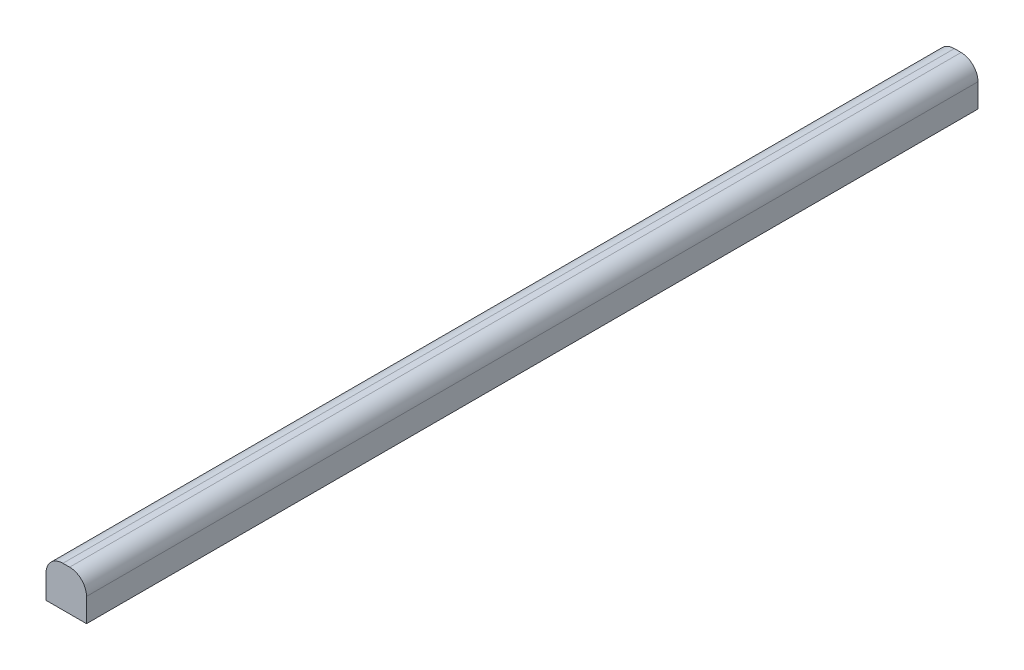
ISO-10303-21;
HEADER;
FILE_DESCRIPTION(('STEP AP214'),'2;1');
FILE_NAME('part.step','',(''),(''),'','','');
FILE_SCHEMA(('AUTOMOTIVE_DESIGN { 1 0 10303 214 1 1 1 1 }'));
ENDSEC;
DATA;
#1=APPLICATION_CONTEXT('core data for automotive mechanical design processes');
#2=APPLICATION_PROTOCOL_DEFINITION('international standard','automotive_design',2000,#1);
#3=PRODUCT_CONTEXT('',#1,'mechanical');
#4=PRODUCT('Part','Part','',(#3));
#5=PRODUCT_RELATED_PRODUCT_CATEGORY('part','',(#4));
#6=PRODUCT_DEFINITION_FORMATION('','',#4);
#7=PRODUCT_DEFINITION_CONTEXT('part definition',#1,'design');
#8=PRODUCT_DEFINITION('design','',#6,#7);
#9=PRODUCT_DEFINITION_SHAPE('','',#8);
#10=(LENGTH_UNIT() NAMED_UNIT(*) SI_UNIT(.MILLI.,.METRE.));
#11=(NAMED_UNIT(*) PLANE_ANGLE_UNIT() SI_UNIT($,.RADIAN.));
#12=(NAMED_UNIT(*) SI_UNIT($,.STERADIAN.) SOLID_ANGLE_UNIT());
#13=UNCERTAINTY_MEASURE_WITH_UNIT(LENGTH_MEASURE(1.E-05),#10,'distance_accuracy_value','');
#14=(GEOMETRIC_REPRESENTATION_CONTEXT(3) GLOBAL_UNCERTAINTY_ASSIGNED_CONTEXT((#13)) GLOBAL_UNIT_ASSIGNED_CONTEXT((#10,
#11,#12)) REPRESENTATION_CONTEXT('',''));
#15=CARTESIAN_POINT('',(0.,0.,0.));
#16=DIRECTION('',(0.,0.,1.));
#17=DIRECTION('',(1.,0.,0.));
#18=AXIS2_PLACEMENT_3D('',#15,#16,#17);
#19=CARTESIAN_POINT('',(0.5,3.,12.5));
#20=DIRECTION('',(0.,1.,0.));
#21=DIRECTION('',(0.,0.,1.));
#22=AXIS2_PLACEMENT_3D('',#19,#20,#21);
#23=PLANE('',#22);
#24=DIRECTION('',(1.,0.,0.));
#25=VECTOR('',#24,1.);
#26=CARTESIAN_POINT('',(0.5,3.,125.));
#27=LINE('',#26,#25);
#28=CARTESIAN_POINT('',(-0.5,3.,125.));
#29=VERTEX_POINT('',#28);
#30=CARTESIAN_POINT('',(0.5,3.,125.));
#31=VERTEX_POINT('',#30);
#32=EDGE_CURVE('E108',#29,#31,#27,.T.);
#33=ORIENTED_EDGE('',*,*,#32,.T.);
#34=DIRECTION('',(0.,0.,1.));
#35=VECTOR('',#34,1.);
#36=CARTESIAN_POINT('',(0.5,3.,12.5));
#37=LINE('',#36,#35);
#38=CARTESIAN_POINT('',(0.5,3.,-7.));
#39=VERTEX_POINT('',#38);
#40=EDGE_CURVE('E104',#39,#31,#37,.T.);
#41=ORIENTED_EDGE('',*,*,#40,.F.);
#42=DIRECTION('',(1.,0.,0.));
#43=VECTOR('',#42,1.);
#44=CARTESIAN_POINT('',(0.5,3.,-7.));
#45=LINE('',#44,#43);
#46=CARTESIAN_POINT('',(-0.5,3.,-7.));
#47=VERTEX_POINT('',#46);
#48=EDGE_CURVE('E75',#39,#47,#45,.F.);
#49=ORIENTED_EDGE('',*,*,#48,.T.);
#50=DIRECTION('',(0.,0.,1.));
#51=VECTOR('',#50,1.);
#52=CARTESIAN_POINT('',(-0.5,3.,12.5));
#53=LINE('',#52,#51);
#54=EDGE_CURVE('E87',#29,#47,#53,.F.);
#55=ORIENTED_EDGE('',*,*,#54,.F.);
#56=EDGE_LOOP('',(#33,#41,#49,#55));
#57=FACE_BOUND('',#56,.T.);
#58=ADVANCED_FACE('F17',(#57),#23,.T.);
#59=CARTESIAN_POINT('',(0.5,0.5,12.5));
#60=DIRECTION('',(0.,0.,1.));
#61=DIRECTION('',(1.,0.,0.));
#62=AXIS2_PLACEMENT_3D('',#59,#60,#61);
#63=CYLINDRICAL_SURFACE('',#62,2.5);
#64=CARTESIAN_POINT('',(0.5,0.5,125.));
#65=DIRECTION('',(0.,0.,1.));
#66=DIRECTION('',(1.,0.,0.));
#67=AXIS2_PLACEMENT_3D('',#64,#65,#66);
#68=CIRCLE('',#67,2.5);
#69=CARTESIAN_POINT('',(3.,0.5,125.));
#70=VERTEX_POINT('',#69);
#71=EDGE_CURVE('E92',#31,#70,#68,.F.);
#72=ORIENTED_EDGE('',*,*,#71,.T.);
#73=DIRECTION('',(0.,0.,1.));
#74=VECTOR('',#73,1.);
#75=CARTESIAN_POINT('',(3.,0.5,12.5));
#76=LINE('',#75,#74);
#77=CARTESIAN_POINT('',(3.,0.5,-7.));
#78=VERTEX_POINT('',#77);
#79=EDGE_CURVE('E89',#78,#70,#76,.T.);
#80=ORIENTED_EDGE('',*,*,#79,.F.);
#81=CARTESIAN_POINT('',(0.5,0.5,-7.));
#82=DIRECTION('',(0.,0.,1.));
#83=DIRECTION('',(1.,0.,0.));
#84=AXIS2_PLACEMENT_3D('',#81,#82,#83);
#85=CIRCLE('',#84,2.5);
#86=EDGE_CURVE('E20',#39,#78,#85,.F.);
#87=ORIENTED_EDGE('',*,*,#86,.F.);
#88=ORIENTED_EDGE('',*,*,#40,.T.);
#89=EDGE_LOOP('',(#72,#80,#87,#88));
#90=FACE_BOUND('',#89,.T.);
#91=ADVANCED_FACE('F90',(#90),#63,.T.);
#92=CARTESIAN_POINT('',(-0.5,0.5,12.5));
#93=DIRECTION('',(0.,0.,1.));
#94=DIRECTION('',(1.,0.,0.));
#95=AXIS2_PLACEMENT_3D('',#92,#93,#94);
#96=CYLINDRICAL_SURFACE('',#95,2.5);
#97=CARTESIAN_POINT('',(-0.5,0.5,125.));
#98=DIRECTION('',(0.,0.,1.));
#99=DIRECTION('',(1.,0.,0.));
#100=AXIS2_PLACEMENT_3D('',#97,#98,#99);
#101=CIRCLE('',#100,2.5);
#102=CARTESIAN_POINT('',(-3.,0.5,125.));
#103=VERTEX_POINT('',#102);
#104=EDGE_CURVE('E112',#103,#29,#101,.F.);
#105=ORIENTED_EDGE('',*,*,#104,.T.);
#106=ORIENTED_EDGE('',*,*,#54,.T.);
#107=CARTESIAN_POINT('',(-0.5,0.5,-7.));
#108=DIRECTION('',(0.,0.,1.));
#109=DIRECTION('',(1.,0.,0.));
#110=AXIS2_PLACEMENT_3D('',#107,#108,#109);
#111=CIRCLE('',#110,2.5);
#112=CARTESIAN_POINT('',(-3.,0.5,-7.));
#113=VERTEX_POINT('',#112);
#114=EDGE_CURVE('E86',#113,#47,#111,.F.);
#115=ORIENTED_EDGE('',*,*,#114,.F.);
#116=DIRECTION('',(0.,0.,1.));
#117=VECTOR('',#116,1.);
#118=CARTESIAN_POINT('',(-3.,0.5,12.5));
#119=LINE('',#118,#117);
#120=EDGE_CURVE('E127',#103,#113,#119,.F.);
#121=ORIENTED_EDGE('',*,*,#120,.F.);
#122=EDGE_LOOP('',(#105,#106,#115,#121));
#123=FACE_BOUND('',#122,.T.);
#124=ADVANCED_FACE('F159',(#123),#96,.T.);
#125=CARTESIAN_POINT('',(0.5,0.5,-7.));
#126=DIRECTION('',(0.,0.,-1.));
#127=DIRECTION('',(-1.,0.,0.));
#128=AXIS2_PLACEMENT_3D('',#125,#126,#127);
#129=PLANE('',#128);
#130=DIRECTION('',(0.,-1.,0.));
#131=VECTOR('',#130,1.);
#132=CARTESIAN_POINT('',(-3.,0.5,-7.));
#133=LINE('',#132,#131);
#134=CARTESIAN_POINT('',(-3.,-3.,-7.));
#135=VERTEX_POINT('',#134);
#136=EDGE_CURVE('E116',#113,#135,#133,.T.);
#137=ORIENTED_EDGE('',*,*,#136,.F.);
#138=ORIENTED_EDGE('',*,*,#114,.T.);
#139=ORIENTED_EDGE('',*,*,#48,.F.);
#140=ORIENTED_EDGE('',*,*,#86,.T.);
#141=DIRECTION('',(0.,1.,0.));
#142=VECTOR('',#141,1.);
#143=CARTESIAN_POINT('',(3.,-3.,-7.));
#144=LINE('',#143,#142);
#145=CARTESIAN_POINT('',(3.,-3.,-7.));
#146=VERTEX_POINT('',#145);
#147=EDGE_CURVE('E82',#146,#78,#144,.T.);
#148=ORIENTED_EDGE('',*,*,#147,.F.);
#149=DIRECTION('',(1.,0.,0.));
#150=VECTOR('',#149,1.);
#151=CARTESIAN_POINT('',(-3.,-3.,-7.));
#152=LINE('',#151,#150);
#153=EDGE_CURVE('E131',#135,#146,#152,.T.);
#154=ORIENTED_EDGE('',*,*,#153,.F.);
#155=EDGE_LOOP('',(#137,#138,#139,#140,#148,#154));
#156=FACE_BOUND('',#155,.T.);
#157=ADVANCED_FACE('F80',(#156),#129,.T.);
#158=CARTESIAN_POINT('',(3.,-3.,12.5));
#159=DIRECTION('',(1.,0.,0.));
#160=DIRECTION('',(0.,1.,0.));
#161=AXIS2_PLACEMENT_3D('',#158,#159,#160);
#162=PLANE('',#161);
#163=DIRECTION('',(0.,1.,0.));
#164=VECTOR('',#163,1.);
#165=CARTESIAN_POINT('',(3.,0.5,125.));
#166=LINE('',#165,#164);
#167=CARTESIAN_POINT('',(3.,-3.,125.));
#168=VERTEX_POINT('',#167);
#169=EDGE_CURVE('E117',#70,#168,#166,.F.);
#170=ORIENTED_EDGE('',*,*,#169,.T.);
#171=DIRECTION('',(0.,0.,1.));
#172=VECTOR('',#171,1.);
#173=CARTESIAN_POINT('',(3.,-3.,12.5));
#174=LINE('',#173,#172);
#175=EDGE_CURVE('E99',#146,#168,#174,.T.);
#176=ORIENTED_EDGE('',*,*,#175,.F.);
#177=ORIENTED_EDGE('',*,*,#147,.T.);
#178=ORIENTED_EDGE('',*,*,#79,.T.);
#179=EDGE_LOOP('',(#170,#176,#177,#178));
#180=FACE_BOUND('',#179,.T.);
#181=ADVANCED_FACE('F97',(#180),#162,.T.);
#182=CARTESIAN_POINT('',(0.5,0.5,125.));
#183=DIRECTION('',(0.,0.,-1.));
#184=DIRECTION('',(-1.,0.,0.));
#185=AXIS2_PLACEMENT_3D('',#182,#183,#184);
#186=PLANE('',#185);
#187=ORIENTED_EDGE('',*,*,#104,.F.);
#188=DIRECTION('',(0.,-1.,0.));
#189=VECTOR('',#188,1.);
#190=CARTESIAN_POINT('',(-3.,0.5,125.));
#191=LINE('',#190,#189);
#192=CARTESIAN_POINT('',(-3.,-3.,125.));
#193=VERTEX_POINT('',#192);
#194=EDGE_CURVE('E40',#193,#103,#191,.F.);
#195=ORIENTED_EDGE('',*,*,#194,.F.);
#196=DIRECTION('',(1.,0.,0.));
#197=VECTOR('',#196,1.);
#198=CARTESIAN_POINT('',(-3.,-3.,125.));
#199=LINE('',#198,#197);
#200=EDGE_CURVE('E27',#168,#193,#199,.F.);
#201=ORIENTED_EDGE('',*,*,#200,.F.);
#202=ORIENTED_EDGE('',*,*,#169,.F.);
#203=ORIENTED_EDGE('',*,*,#71,.F.);
#204=ORIENTED_EDGE('',*,*,#32,.F.);
#205=EDGE_LOOP('',(#187,#195,#201,#202,#203,#204));
#206=FACE_BOUND('',#205,.T.);
#207=ADVANCED_FACE('F165',(#206),#186,.F.);
#208=CARTESIAN_POINT('',(-3.,0.5,12.5));
#209=DIRECTION('',(-1.,0.,0.));
#210=DIRECTION('',(0.,-1.,0.));
#211=AXIS2_PLACEMENT_3D('',#208,#209,#210);
#212=PLANE('',#211);
#213=ORIENTED_EDGE('',*,*,#194,.T.);
#214=ORIENTED_EDGE('',*,*,#120,.T.);
#215=ORIENTED_EDGE('',*,*,#136,.T.);
#216=DIRECTION('',(0.,0.,1.));
#217=VECTOR('',#216,1.);
#218=CARTESIAN_POINT('',(-3.,-3.,12.5));
#219=LINE('',#218,#217);
#220=EDGE_CURVE('E11',#193,#135,#219,.F.);
#221=ORIENTED_EDGE('',*,*,#220,.F.);
#222=EDGE_LOOP('',(#213,#214,#215,#221));
#223=FACE_BOUND('',#222,.T.);
#224=ADVANCED_FACE('F156',(#223),#212,.T.);
#225=CARTESIAN_POINT('',(-3.,-3.,12.5));
#226=DIRECTION('',(0.,-1.,0.));
#227=DIRECTION('',(1.,0.,0.));
#228=AXIS2_PLACEMENT_3D('',#225,#226,#227);
#229=PLANE('',#228);
#230=ORIENTED_EDGE('',*,*,#200,.T.);
#231=ORIENTED_EDGE('',*,*,#220,.T.);
#232=ORIENTED_EDGE('',*,*,#153,.T.);
#233=ORIENTED_EDGE('',*,*,#175,.T.);
#234=EDGE_LOOP('',(#230,#231,#232,#233));
#235=FACE_BOUND('',#234,.T.);
#236=ADVANCED_FACE('F154',(#235),#229,.T.);
#237=CLOSED_SHELL('',(#58,#91,#124,#157,#181,#207,#224,#236));
#238=MANIFOLD_SOLID_BREP('B1',#237);
#239=ADVANCED_BREP_SHAPE_REPRESENTATION('',(#18,#238),#14);
#240=SHAPE_DEFINITION_REPRESENTATION(#9,#239);
ENDSEC;
END-ISO-10303-21;
